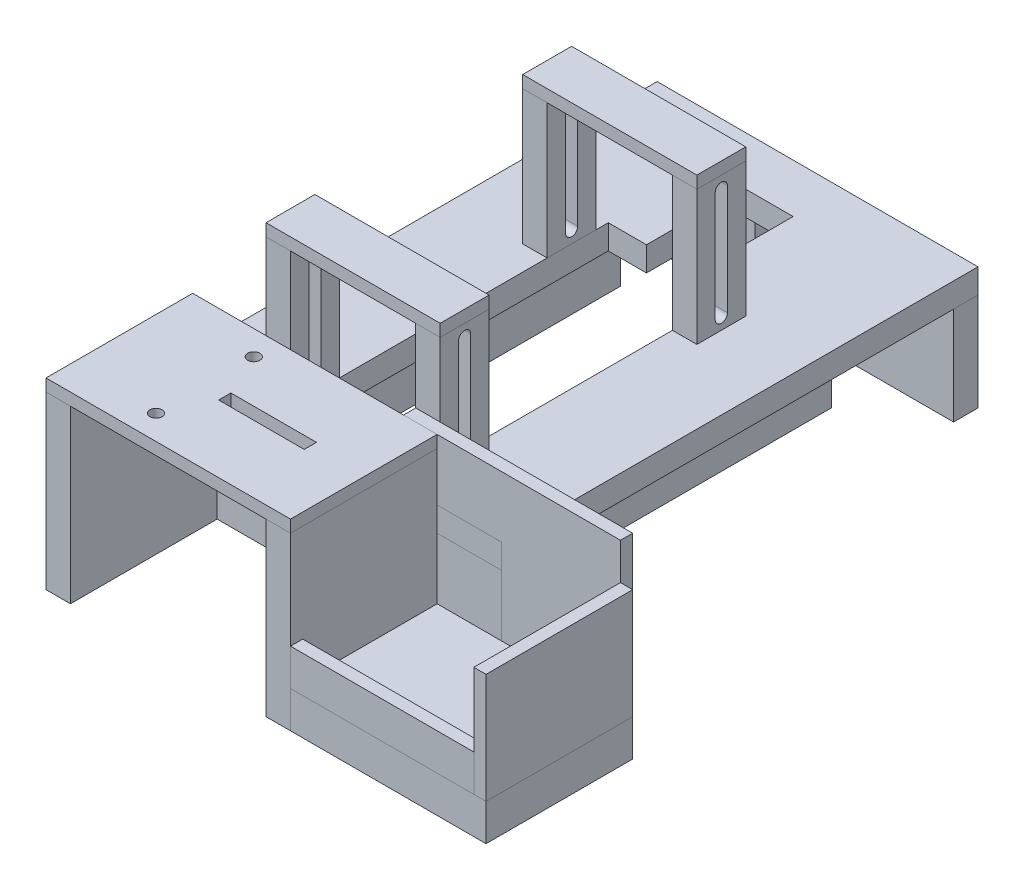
from build123d import *

# Parameters (mm, degrees)
BOSS_EXTRUDE1_DEPTH   = 12.7
SKETCH2_W             = 25.4
SKETCH2_H             = 50.8
CUT_EXTRUDE1_DEPTH    = 19.05
SKETCH3_W             = 31.75
SKETCH3_H             = 12.7
BOSS_EXTRUDE2_DEPTH   = 50.8
SKETCH3_W_2           = 38.1
BOSS_EXTRUDE2_2_DEPTH = 50.8
SKETCH3_W_3           = 63.5
BOSS_EXTRUDE2_3_DEPTH = 50.8
BOSS_EXTRUDE2_4_DEPTH = 50.8
SKETCH4_W             = 12.7
SKETCH4_H             = 209.55
BOSS_EXTRUDE3_DEPTH   = 50.8
SKETCH4_H_2           = 285.75
BOSS_EXTRUDE3_2_DEPTH = 50.8
SKETCH5_W             = 12.7
SKETCH5_H             = 76.2
BOSS_EXTRUDE4_DEPTH   = 38.1
SKETCH6_W             = 127
SKETCH6_H             = 76.2
BOSS_EXTRUDE5_DEPTH   = 6.35
SKETCH7_R             = 3.175
SKETCH7_W             = 44.45
SKETCH7_H             = 6.35
CUT_EXTRUDE2_DEPTH    = 6.35
SKETCH8_W             = 12.7
SKETCH8_H             = 25.4
BOSS_EXTRUDE6_DEPTH   = 69.85
BOSS_EXTRUDE6_2_DEPTH = 69.85
BOSS_EXTRUDE6_3_DEPTH = 69.85
BOSS_EXTRUDE6_4_DEPTH = 69.85
SKETCH9_W             = 90.4875
SKETCH9_H             = 25.4
BOSS_EXTRUDE7_DEPTH   = 6.35
BOSS_EXTRUDE7_2_DEPTH = 6.35
CUT_EXTRUDE3_DEPTH    = 120.65
SKETCH11_W            = 12.7
SKETCH11_H            = 76.2
BOSS_EXTRUDE8_DEPTH   = 88.9
SKETCH12_W            = 101.6
SKETCH12_H            = 76.2
BOSS_EXTRUDE9_DEPTH   = 19.05
SKETCH13_W            = 6.35
SKETCH13_H            = 76.2
BOSS_EXTRUDE10_DEPTH  = 57.15
BOSS_EXTRUDE11_DEPTH  = 6.35
SKETCH15_W            = 95.25
SKETCH15_H            = 6.35
BOSS_EXTRUDE12_DEPTH  = 19.05


with BuildPart() as part:
    # Sketch1 → Boss-Extrude1 (new body)
    with BuildSketch(Plane(origin=(0, 0, 0), x_dir=(1, 0, 0), z_dir=(0, 1, 0))):
        Polygon((0, 0), (-50.8, 0), (-50.8, 247.65), (115.8875, 247.65), (115.8875, 0), (65.0875, 0), (65.0875, 171.45), (0, 171.45), align=None)
    extrude(amount=BOSS_EXTRUDE1_DEPTH)

    # Sketch2 → Cut-Extrude1 (cut)
    with BuildSketch(Plane(origin=(0, 12.7, 0), x_dir=(1, 0, 0), z_dir=(0, 1, 0))):
        with Locations((32.54375, 196.85)):
            Rectangle(SKETCH2_W, SKETCH2_H)
    extrude(amount=-CUT_EXTRUDE1_DEPTH, mode=Mode.SUBTRACT)


with BuildPart() as body_2:
    # Sketch3 → Boss-Extrude2 (new body)
    with BuildSketch(Plane.XZ):
        with Locations((-15.875, -6.35)):
            Rectangle(SKETCH3_W, SKETCH3_H)
    extrude(amount=BOSS_EXTRUDE2_DEPTH)


with BuildPart() as body_3:
    # Sketch3 → Boss-Extrude2 2 (new body)
    with BuildSketch(Plane.XZ):
        with Locations((96.8375, -6.35)):
            Rectangle(SKETCH3_W_2, SKETCH3_H)
    extrude(amount=BOSS_EXTRUDE2_2_DEPTH)


with BuildPart() as body_4:
    # Sketch3 → Boss-Extrude2 3 (new body)
    with BuildSketch(Plane.XZ):
        with Locations((-19.05, -241.3)):
            Rectangle(SKETCH3_W_3, SKETCH3_H)
    extrude(amount=BOSS_EXTRUDE2_3_DEPTH)


with BuildPart() as body_5:
    # Sketch3 → Boss-Extrude2 4 (new body)
    with BuildSketch(Plane.XZ):
        with Locations((84.1375, -241.3)):
            Rectangle(SKETCH3_W_3, SKETCH3_H)
    extrude(amount=BOSS_EXTRUDE2_4_DEPTH)


with BuildPart() as body_6:
    # Sketch4 → Boss-Extrude3 (new body)
    with BuildSketch(Plane.XZ):
        with Locations((71.4375, -104.775)):
            Rectangle(SKETCH4_W, SKETCH4_H)
    extrude(amount=BOSS_EXTRUDE3_DEPTH)


with BuildPart() as body_7:
    # Sketch4 → Boss-Extrude3 2 (new body)
    with BuildSketch(Plane.XZ):
        with Locations((-38.1, -66.675)):
            Rectangle(SKETCH4_W, SKETCH4_H_2)
    extrude(amount=BOSS_EXTRUDE3_2_DEPTH)

    # Sketch5 → Boss-Extrude4 (add)
    with BuildSketch(Plane(origin=(0, 0, 0), x_dir=(1, 0, 0), z_dir=(0, 1, 0))):
        with Locations((-38.1, -38.1)):
            Rectangle(SKETCH5_W, SKETCH5_H)
    extrude(amount=BOSS_EXTRUDE4_DEPTH)


with BuildPart() as body_8:
    # Sketch6 → Boss-Extrude5 (new body)
    with BuildSketch(Plane(origin=(0, 38.1, 0), x_dir=(1, 0, 0), z_dir=(0, 1, 0))):
        with Locations((19.05, -38.1)):
            Rectangle(SKETCH6_W, SKETCH6_H)
    extrude(amount=BOSS_EXTRUDE5_DEPTH)

    # Sketch7 → Cut-Extrude2 (cut)
    with BuildSketch(Plane(origin=(0, 44.45, 0), x_dir=(1, 0, 0), z_dir=(0, 1, 0))):
        with Locations(Location((0, -12.7, 0), (0, 0, 270))):
            Circle(SKETCH7_R)
        with Locations(Location((0, -63.5, 0), (0, 0, 90))):
            Circle(SKETCH7_R)
        with Locations((32.54375, -38.1)):
            Rectangle(SKETCH7_W, SKETCH7_H)
    extrude(amount=-CUT_EXTRUDE2_DEPTH, mode=Mode.SUBTRACT)


with BuildPart() as body_9:
    # Sketch8 → Boss-Extrude6 (new body)
    with BuildSketch(Plane(origin=(0, 12.7, 0), x_dir=(1, 0, 0), z_dir=(0, 1, 0))):
        with Locations((-6.35, 152.4)):
            Rectangle(SKETCH8_W, SKETCH8_H)
    extrude(amount=BOSS_EXTRUDE6_DEPTH)


with BuildPart() as body_10:
    # Sketch8 → Boss-Extrude6 2 (new body)
    with BuildSketch(Plane(origin=(0, 12.7, 0), x_dir=(1, 0, 0), z_dir=(0, 1, 0))):
        with Locations((-6.35, 19.05)):
            Rectangle(SKETCH8_W, SKETCH8_H)
    extrude(amount=BOSS_EXTRUDE6_2_DEPTH)


with BuildPart() as body_11:
    # Sketch8 → Boss-Extrude6 3 (new body)
    with BuildSketch(Plane(origin=(0, 12.7, 0), x_dir=(1, 0, 0), z_dir=(0, 1, 0))):
        with Locations((71.4375, 19.05)):
            Rectangle(SKETCH8_W, SKETCH8_H)
    extrude(amount=BOSS_EXTRUDE6_3_DEPTH)


with BuildPart() as body_12:
    # Sketch8 → Boss-Extrude6 4 (new body)
    with BuildSketch(Plane(origin=(0, 12.7, 0), x_dir=(1, 0, 0), z_dir=(0, 1, 0))):
        with Locations((71.4375, 152.4)):
            Rectangle(SKETCH8_W, SKETCH8_H)
    extrude(amount=BOSS_EXTRUDE6_4_DEPTH)


with BuildPart() as body_13:
    # Sketch9 → Boss-Extrude7 (new body)
    with BuildSketch(Plane(origin=(0, 82.55, 0), x_dir=(1, 0, 0), z_dir=(0, 1, 0))):
        with Locations((32.54375, 19.05)):
            Rectangle(SKETCH9_W, SKETCH9_H)
    extrude(amount=BOSS_EXTRUDE7_DEPTH)


with BuildPart() as body_14:
    # Sketch9 → Boss-Extrude7 2 (new body)
    with BuildSketch(Plane(origin=(0, 82.55, 0), x_dir=(1, 0, 0), z_dir=(0, 1, 0))):
        with Locations((32.54375, 152.4)):
            Rectangle(SKETCH9_W, SKETCH9_H)
    extrude(amount=BOSS_EXTRUDE7_2_DEPTH)


with BuildPart() as cut_extrude3_tool:
    # Sketch10 → Cut-Extrude3 (new body)
    with BuildSketch(Plane.ZY.offset(12.7)):
        with BuildLine():
            Line((-149.225, 76.2), (-149.225, 19.05))
            ThreePointArc((-149.225, 19.05), (-152.4, 15.875), (-155.575, 19.05))
            Line((-155.575, 19.05), (-155.575, 76.2))
            ThreePointArc((-155.575, 76.2), (-152.4, 79.375), (-149.225, 76.2))
        make_face()
        with BuildLine():
            Line((-22.225, 76.2), (-22.225, 19.05))
            ThreePointArc((-22.225, 19.05), (-19.05, 15.875), (-15.875, 19.05))
            Line((-15.875, 19.05), (-15.875, 76.2))
            ThreePointArc((-15.875, 76.2), (-19.05, 79.375), (-22.225, 76.2))
        make_face()
    extrude(amount=-CUT_EXTRUDE3_DEPTH)


with BuildPart() as body_9_1:
    add(body_9.part)

    # Cut-Extrude3: cut by cut_extrude3_tool
    add(cut_extrude3_tool.part, mode=Mode.SUBTRACT)


with BuildPart() as body_10_1:
    add(body_10.part)

    # Cut-Extrude3: cut by cut_extrude3_tool
    add(cut_extrude3_tool.part, mode=Mode.SUBTRACT)


with BuildPart() as body_11_1:
    add(body_11.part)

    # Cut-Extrude3: cut by cut_extrude3_tool
    add(cut_extrude3_tool.part, mode=Mode.SUBTRACT)


with BuildPart() as body_12_1:
    add(body_12.part)

    # Cut-Extrude3: cut by cut_extrude3_tool
    add(cut_extrude3_tool.part, mode=Mode.SUBTRACT)


with BuildPart() as body_15:
    # Sketch11 → Boss-Extrude8 (new body)
    with BuildSketch(Plane.XZ.offset(-38.1)):
        with Locations((76.2, 38.1)):
            Rectangle(SKETCH11_W, SKETCH11_H)
    extrude(amount=BOSS_EXTRUDE8_DEPTH)


with BuildPart() as body_16:
    # Sketch12 → Boss-Extrude9 (new body)
    with BuildSketch(Plane.XZ.offset(50.8)):
        with Locations((133.35, 38.1)):
            Rectangle(SKETCH12_W, SKETCH12_H)
    extrude(amount=-BOSS_EXTRUDE9_DEPTH)


with BuildPart() as body_17:
    # Sketch13 → Boss-Extrude10 (new body)
    with BuildSketch(Plane(origin=(0, -31.75, 0), x_dir=(1, 0, 0), z_dir=(0, 1, 0))):
        with Locations((180.975, -38.1)):
            Rectangle(SKETCH13_W, SKETCH13_H)
    extrude(amount=BOSS_EXTRUDE10_DEPTH)


with BuildPart() as body_18:
    # Sketch14 → Boss-Extrude11 (new body)
    with BuildSketch(Plane(origin=(0, 0, 0), x_dir=(-1, 0, 0), z_dir=(0, 0, -1))):
        Polygon((-115.8875, -50.8), (-177.8, -50.8), (-177.8, 44.45), (-65.0875, 44.45), (-65.0875, 12.7), (-115.8875, 12.7), align=None)
    extrude(amount=BOSS_EXTRUDE11_DEPTH)


with BuildPart() as body_19:
    # Sketch15 → Boss-Extrude12 (new body)
    with BuildSketch(Plane(origin=(0, -31.75, 0), x_dir=(1, 0, 0), z_dir=(0, 1, 0))):
        with Locations((130.175, -73.025)):
            Rectangle(SKETCH15_W, SKETCH15_H)
    extrude(amount=BOSS_EXTRUDE12_DEPTH)


solid = Compound([part.part, body_2.part, body_3.part, body_4.part, body_5.part, body_6.part, body_7.part, body_8.part, body_13.part, body_14.part, body_9_1.part, body_10_1.part, body_11_1.part, body_12_1.part, body_15.part, body_16.part, body_17.part, body_18.part, body_19.part])
